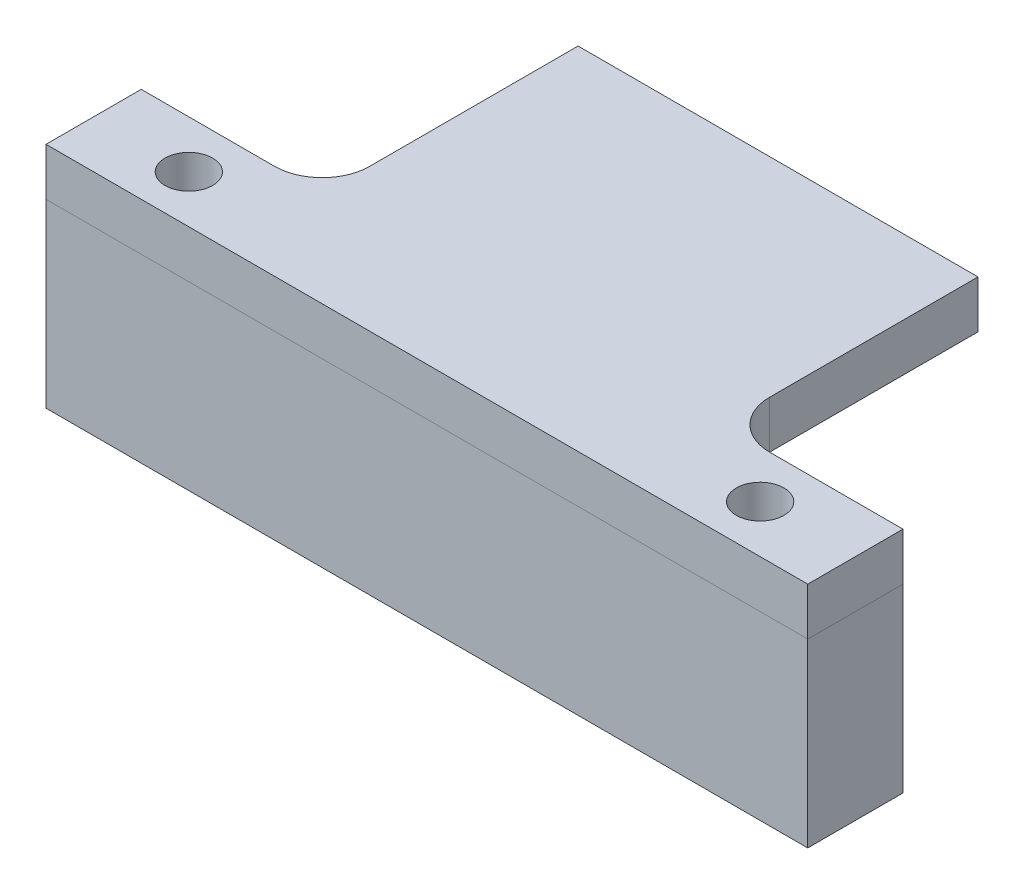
ISO-10303-21;
HEADER;
FILE_DESCRIPTION(('STEP AP214'),'2;1');
FILE_NAME('part.step','',(''),(''),'','','');
FILE_SCHEMA(('AUTOMOTIVE_DESIGN { 1 0 10303 214 1 1 1 1 }'));
ENDSEC;
DATA;
#1=APPLICATION_CONTEXT('core data for automotive mechanical design processes');
#2=APPLICATION_PROTOCOL_DEFINITION('international standard','automotive_design',2000,#1);
#3=PRODUCT_CONTEXT('',#1,'mechanical');
#4=PRODUCT('Part','Part','',(#3));
#5=PRODUCT_RELATED_PRODUCT_CATEGORY('part','',(#4));
#6=PRODUCT_DEFINITION_FORMATION('','',#4);
#7=PRODUCT_DEFINITION_CONTEXT('part definition',#1,'design');
#8=PRODUCT_DEFINITION('design','',#6,#7);
#9=PRODUCT_DEFINITION_SHAPE('','',#8);
#10=(LENGTH_UNIT() NAMED_UNIT(*) SI_UNIT(.MILLI.,.METRE.));
#11=(NAMED_UNIT(*) PLANE_ANGLE_UNIT() SI_UNIT($,.RADIAN.));
#12=(NAMED_UNIT(*) SI_UNIT($,.STERADIAN.) SOLID_ANGLE_UNIT());
#13=UNCERTAINTY_MEASURE_WITH_UNIT(LENGTH_MEASURE(1.E-05),#10,'distance_accuracy_value','');
#14=(GEOMETRIC_REPRESENTATION_CONTEXT(3) GLOBAL_UNCERTAINTY_ASSIGNED_CONTEXT((#13)) GLOBAL_UNIT_ASSIGNED_CONTEXT((#10,
#11,#12)) REPRESENTATION_CONTEXT('',''));
#15=CARTESIAN_POINT('',(0.,0.,0.));
#16=DIRECTION('',(0.,0.,1.));
#17=DIRECTION('',(1.,0.,0.));
#18=AXIS2_PLACEMENT_3D('',#15,#16,#17);
#19=CARTESIAN_POINT('',(0.,15.24,-3.175));
#20=DIRECTION('',(0.,0.,1.));
#21=DIRECTION('',(1.,0.,0.));
#22=AXIS2_PLACEMENT_3D('',#19,#20,#21);
#23=PLANE('',#22);
#24=DIRECTION('',(-1.,0.,0.));
#25=VECTOR('',#24,1.);
#26=CARTESIAN_POINT('',(0.,15.24,-3.175));
#27=LINE('',#26,#25);
#28=CARTESIAN_POINT('',(-16.51,15.24,-3.175));
#29=VERTEX_POINT('',#28);
#30=CARTESIAN_POINT('',(-25.4,15.24,-3.175));
#31=VERTEX_POINT('',#30);
#32=EDGE_CURVE('E173',#29,#31,#27,.T.);
#33=ORIENTED_EDGE('',*,*,#32,.F.);
#34=DIRECTION('',(0.,1.,0.));
#35=VECTOR('',#34,1.);
#36=CARTESIAN_POINT('',(-16.51,15.24,-3.175));
#37=LINE('',#36,#35);
#38=CARTESIAN_POINT('',(-16.51,12.065,-3.175));
#39=VERTEX_POINT('',#38);
#40=EDGE_CURVE('E202',#29,#39,#37,.F.);
#41=ORIENTED_EDGE('',*,*,#40,.T.);
#42=DIRECTION('',(-1.,0.,0.));
#43=VECTOR('',#42,1.);
#44=CARTESIAN_POINT('',(0.,12.065,-3.175));
#45=LINE('',#44,#43);
#46=CARTESIAN_POINT('',(-25.4,12.065,-3.175));
#47=VERTEX_POINT('',#46);
#48=EDGE_CURVE('E183',#39,#47,#45,.T.);
#49=ORIENTED_EDGE('',*,*,#48,.T.);
#50=DIRECTION('',(0.,-1.,0.));
#51=VECTOR('',#50,1.);
#52=CARTESIAN_POINT('',(-25.4,15.24,-3.175));
#53=LINE('',#52,#51);
#54=EDGE_CURVE('E190',#31,#47,#53,.T.);
#55=ORIENTED_EDGE('',*,*,#54,.F.);
#56=EDGE_LOOP('',(#33,#41,#49,#55));
#57=FACE_BOUND('',#56,.T.);
#58=ADVANCED_FACE('F53',(#57),#23,.F.);
#59=CARTESIAN_POINT('',(0.,15.24,3.175));
#60=DIRECTION('',(0.,0.,-1.));
#61=DIRECTION('',(-1.,0.,0.));
#62=AXIS2_PLACEMENT_3D('',#59,#60,#61);
#63=PLANE('',#62);
#64=DIRECTION('',(1.,0.,0.));
#65=VECTOR('',#64,1.);
#66=CARTESIAN_POINT('',(0.,12.065,3.175));
#67=LINE('',#66,#65);
#68=CARTESIAN_POINT('',(-25.4,12.065,3.175));
#69=VERTEX_POINT('',#68);
#70=CARTESIAN_POINT('',(25.4,12.065,3.175));
#71=VERTEX_POINT('',#70);
#72=EDGE_CURVE('E165',#69,#71,#67,.T.);
#73=ORIENTED_EDGE('',*,*,#72,.T.);
#74=DIRECTION('',(0.,-1.,0.));
#75=VECTOR('',#74,1.);
#76=CARTESIAN_POINT('',(25.4,15.24,3.175));
#77=LINE('',#76,#75);
#78=CARTESIAN_POINT('',(25.4,15.24,3.175));
#79=VERTEX_POINT('',#78);
#80=EDGE_CURVE('E196',#79,#71,#77,.T.);
#81=ORIENTED_EDGE('',*,*,#80,.F.);
#82=DIRECTION('',(1.,0.,0.));
#83=VECTOR('',#82,1.);
#84=CARTESIAN_POINT('',(0.,15.24,3.175));
#85=LINE('',#84,#83);
#86=CARTESIAN_POINT('',(-25.4,15.24,3.175));
#87=VERTEX_POINT('',#86);
#88=EDGE_CURVE('E168',#87,#79,#85,.T.);
#89=ORIENTED_EDGE('',*,*,#88,.F.);
#90=DIRECTION('',(0.,-1.,0.));
#91=VECTOR('',#90,1.);
#92=CARTESIAN_POINT('',(-25.4,15.24,3.175));
#93=LINE('',#92,#91);
#94=EDGE_CURVE('E178',#87,#69,#93,.T.);
#95=ORIENTED_EDGE('',*,*,#94,.T.);
#96=EDGE_LOOP('',(#73,#81,#89,#95));
#97=FACE_BOUND('',#96,.T.);
#98=ADVANCED_FACE('F236',(#97),#63,.F.);
#99=CARTESIAN_POINT('',(25.4,15.24,0.));
#100=DIRECTION('',(-1.,0.,0.));
#101=DIRECTION('',(0.,0.,1.));
#102=AXIS2_PLACEMENT_3D('',#99,#100,#101);
#103=PLANE('',#102);
#104=DIRECTION('',(0.,0.,-1.));
#105=VECTOR('',#104,1.);
#106=CARTESIAN_POINT('',(25.4,12.065,0.));
#107=LINE('',#106,#105);
#108=CARTESIAN_POINT('',(25.4,12.065,-3.175));
#109=VERTEX_POINT('',#108);
#110=EDGE_CURVE('E181',#71,#109,#107,.T.);
#111=ORIENTED_EDGE('',*,*,#110,.T.);
#112=DIRECTION('',(0.,-1.,0.));
#113=VECTOR('',#112,1.);
#114=CARTESIAN_POINT('',(25.4,15.24,-3.175));
#115=LINE('',#114,#113);
#116=CARTESIAN_POINT('',(25.4,15.24,-3.175));
#117=VERTEX_POINT('',#116);
#118=EDGE_CURVE('E193',#117,#109,#115,.T.);
#119=ORIENTED_EDGE('',*,*,#118,.F.);
#120=DIRECTION('',(0.,0.,-1.));
#121=VECTOR('',#120,1.);
#122=CARTESIAN_POINT('',(25.4,15.24,0.));
#123=LINE('',#122,#121);
#124=EDGE_CURVE('E170',#79,#117,#123,.T.);
#125=ORIENTED_EDGE('',*,*,#124,.F.);
#126=ORIENTED_EDGE('',*,*,#80,.T.);
#127=EDGE_LOOP('',(#111,#119,#125,#126));
#128=FACE_BOUND('',#127,.T.);
#129=ADVANCED_FACE('F238',(#128),#103,.F.);
#130=CARTESIAN_POINT('',(16.51,12.065,-3.175));
#131=VERTEX_POINT('',#130);
#132=EDGE_CURVE('E184',#109,#131,#45,.T.);
#133=ORIENTED_EDGE('',*,*,#132,.T.);
#134=DIRECTION('',(0.,1.,0.));
#135=VECTOR('',#134,1.);
#136=CARTESIAN_POINT('',(16.51,15.24,-3.175));
#137=LINE('',#136,#135);
#138=CARTESIAN_POINT('',(16.51,15.24,-3.175));
#139=VERTEX_POINT('',#138);
#140=EDGE_CURVE('E204',#131,#139,#137,.T.);
#141=ORIENTED_EDGE('',*,*,#140,.T.);
#142=EDGE_CURVE('E174',#117,#139,#27,.T.);
#143=ORIENTED_EDGE('',*,*,#142,.F.);
#144=ORIENTED_EDGE('',*,*,#118,.T.);
#145=EDGE_LOOP('',(#133,#141,#143,#144));
#146=FACE_BOUND('',#145,.T.);
#147=ADVANCED_FACE('F242',(#146),#23,.F.);
#148=CARTESIAN_POINT('',(-25.4,15.24,0.));
#149=DIRECTION('',(1.,0.,0.));
#150=DIRECTION('',(0.,0.,-1.));
#151=AXIS2_PLACEMENT_3D('',#148,#149,#150);
#152=PLANE('',#151);
#153=DIRECTION('',(0.,0.,1.));
#154=VECTOR('',#153,1.);
#155=CARTESIAN_POINT('',(-25.4,12.065,0.));
#156=LINE('',#155,#154);
#157=EDGE_CURVE('E171',#47,#69,#156,.T.);
#158=ORIENTED_EDGE('',*,*,#157,.T.);
#159=ORIENTED_EDGE('',*,*,#94,.F.);
#160=DIRECTION('',(0.,0.,1.));
#161=VECTOR('',#160,1.);
#162=CARTESIAN_POINT('',(-25.4,15.24,0.));
#163=LINE('',#162,#161);
#164=EDGE_CURVE('E176',#31,#87,#163,.T.);
#165=ORIENTED_EDGE('',*,*,#164,.F.);
#166=ORIENTED_EDGE('',*,*,#54,.T.);
#167=EDGE_LOOP('',(#158,#159,#165,#166));
#168=FACE_BOUND('',#167,.T.);
#169=ADVANCED_FACE('F231',(#168),#152,.F.);
#170=CARTESIAN_POINT('',(0.,15.24,0.));
#171=DIRECTION('',(0.,1.,0.));
#172=DIRECTION('',(0.,0.,1.));
#173=AXIS2_PLACEMENT_3D('',#170,#171,#172);
#174=PLANE('',#173);
#175=CARTESIAN_POINT('',(19.05,15.24,0.));
#176=DIRECTION('',(0.,-1.,0.));
#177=DIRECTION('',(0.,0.,-1.));
#178=AXIS2_PLACEMENT_3D('',#175,#176,#177);
#179=CIRCLE('',#178,1.5875);
#180=CARTESIAN_POINT('',(19.05,15.24,-1.5875));
#181=VERTEX_POINT('',#180);
#182=EDGE_CURVE('E156',#181,#181,#179,.T.);
#183=ORIENTED_EDGE('',*,*,#182,.T.);
#184=EDGE_LOOP('',(#183));
#185=FACE_BOUND('',#184,.T.);
#186=CARTESIAN_POINT('',(-19.05,15.24,0.));
#187=DIRECTION('',(0.,-1.,0.));
#188=DIRECTION('',(0.,0.,-1.));
#189=AXIS2_PLACEMENT_3D('',#186,#187,#188);
#190=CIRCLE('',#189,1.5875);
#191=CARTESIAN_POINT('',(-19.05,15.24,-1.5875));
#192=VERTEX_POINT('',#191);
#193=EDGE_CURVE('E162',#192,#192,#190,.T.);
#194=ORIENTED_EDGE('',*,*,#193,.T.);
#195=EDGE_LOOP('',(#194));
#196=FACE_BOUND('',#195,.T.);
#197=ORIENTED_EDGE('',*,*,#88,.T.);
#198=ORIENTED_EDGE('',*,*,#124,.T.);
#199=ORIENTED_EDGE('',*,*,#142,.T.);
#200=CARTESIAN_POINT('',(16.51,15.24,-6.35));
#201=DIRECTION('',(0.,1.,0.));
#202=DIRECTION('',(0.,0.,1.));
#203=AXIS2_PLACEMENT_3D('',#200,#201,#202);
#204=CIRCLE('',#203,3.175);
#205=CARTESIAN_POINT('',(13.335,15.24,-6.35));
#206=VERTEX_POINT('',#205);
#207=EDGE_CURVE('E61',#139,#206,#204,.F.);
#208=ORIENTED_EDGE('',*,*,#207,.T.);
#209=DIRECTION('',(0.,0.,-1.));
#210=VECTOR('',#209,1.);
#211=CARTESIAN_POINT('',(13.335,15.24,-20.2438));
#212=LINE('',#211,#210);
#213=CARTESIAN_POINT('',(13.335,15.24,-20.2438));
#214=VERTEX_POINT('',#213);
#215=EDGE_CURVE('E127',#206,#214,#212,.T.);
#216=ORIENTED_EDGE('',*,*,#215,.T.);
#217=DIRECTION('',(-1.,0.,0.));
#218=VECTOR('',#217,1.);
#219=CARTESIAN_POINT('',(-13.335,15.24,-20.2438));
#220=LINE('',#219,#218);
#221=CARTESIAN_POINT('',(-13.335,15.24,-20.2438));
#222=VERTEX_POINT('',#221);
#223=EDGE_CURVE('E133',#214,#222,#220,.T.);
#224=ORIENTED_EDGE('',*,*,#223,.T.);
#225=DIRECTION('',(0.,0.,1.));
#226=VECTOR('',#225,1.);
#227=CARTESIAN_POINT('',(-13.335,15.24,-20.2438));
#228=LINE('',#227,#226);
#229=CARTESIAN_POINT('',(-13.335,15.24,-6.35));
#230=VERTEX_POINT('',#229);
#231=EDGE_CURVE('E142',#222,#230,#228,.T.);
#232=ORIENTED_EDGE('',*,*,#231,.T.);
#233=CARTESIAN_POINT('',(-16.51,15.24,-6.35));
#234=DIRECTION('',(0.,1.,0.));
#235=DIRECTION('',(0.,0.,1.));
#236=AXIS2_PLACEMENT_3D('',#233,#234,#235);
#237=CIRCLE('',#236,3.175);
#238=EDGE_CURVE('E208',#230,#29,#237,.F.);
#239=ORIENTED_EDGE('',*,*,#238,.T.);
#240=ORIENTED_EDGE('',*,*,#32,.T.);
#241=ORIENTED_EDGE('',*,*,#164,.T.);
#242=EDGE_LOOP('',(#197,#198,#199,#208,#216,#224,#232,#239,#240,#241));
#243=FACE_BOUND('',#242,.T.);
#244=ADVANCED_FACE('F130',(#185,#196,#243),#174,.T.);
#245=CARTESIAN_POINT('',(0.,12.065,0.));
#246=DIRECTION('',(0.,1.,0.));
#247=DIRECTION('',(0.,0.,1.));
#248=AXIS2_PLACEMENT_3D('',#245,#246,#247);
#249=PLANE('',#248);
#250=CARTESIAN_POINT('',(19.05,12.065,0.));
#251=DIRECTION('',(0.,-1.,0.));
#252=DIRECTION('',(0.,0.,-1.));
#253=AXIS2_PLACEMENT_3D('',#250,#251,#252);
#254=CIRCLE('',#253,1.5875);
#255=CARTESIAN_POINT('',(19.05,12.065,-1.5875));
#256=VERTEX_POINT('',#255);
#257=EDGE_CURVE('E155',#256,#256,#254,.T.);
#258=ORIENTED_EDGE('',*,*,#257,.F.);
#259=EDGE_LOOP('',(#258));
#260=FACE_BOUND('',#259,.T.);
#261=CARTESIAN_POINT('',(-19.05,12.065,0.));
#262=DIRECTION('',(0.,-1.,0.));
#263=DIRECTION('',(0.,0.,-1.));
#264=AXIS2_PLACEMENT_3D('',#261,#262,#263);
#265=CIRCLE('',#264,1.5875);
#266=CARTESIAN_POINT('',(-19.05,12.065,-1.5875));
#267=VERTEX_POINT('',#266);
#268=EDGE_CURVE('E159',#267,#267,#265,.T.);
#269=ORIENTED_EDGE('',*,*,#268,.F.);
#270=EDGE_LOOP('',(#269));
#271=FACE_BOUND('',#270,.T.);
#272=ORIENTED_EDGE('',*,*,#72,.F.);
#273=ORIENTED_EDGE('',*,*,#157,.F.);
#274=ORIENTED_EDGE('',*,*,#48,.F.);
#275=CARTESIAN_POINT('',(-16.51,12.065,-6.35));
#276=DIRECTION('',(0.,1.,0.));
#277=DIRECTION('',(0.,0.,1.));
#278=AXIS2_PLACEMENT_3D('',#275,#276,#277);
#279=CIRCLE('',#278,3.175);
#280=CARTESIAN_POINT('',(-13.335,12.065,-6.35));
#281=VERTEX_POINT('',#280);
#282=EDGE_CURVE('E210',#39,#281,#279,.T.);
#283=ORIENTED_EDGE('',*,*,#282,.T.);
#284=DIRECTION('',(0.,0.,-1.));
#285=VECTOR('',#284,1.);
#286=CARTESIAN_POINT('',(-13.335,12.065,-20.2438));
#287=LINE('',#286,#285);
#288=CARTESIAN_POINT('',(-13.335,12.065,-20.2438));
#289=VERTEX_POINT('',#288);
#290=EDGE_CURVE('E151',#281,#289,#287,.T.);
#291=ORIENTED_EDGE('',*,*,#290,.T.);
#292=DIRECTION('',(1.,0.,0.));
#293=VECTOR('',#292,1.);
#294=CARTESIAN_POINT('',(-13.335,12.065,-20.2438));
#295=LINE('',#294,#293);
#296=CARTESIAN_POINT('',(13.335,12.065,-20.2438));
#297=VERTEX_POINT('',#296);
#298=EDGE_CURVE('E153',#289,#297,#295,.T.);
#299=ORIENTED_EDGE('',*,*,#298,.T.);
#300=DIRECTION('',(0.,0.,1.));
#301=VECTOR('',#300,1.);
#302=CARTESIAN_POINT('',(13.335,12.065,-20.2438));
#303=LINE('',#302,#301);
#304=CARTESIAN_POINT('',(13.335,12.065,-6.35));
#305=VERTEX_POINT('',#304);
#306=EDGE_CURVE('E138',#297,#305,#303,.T.);
#307=ORIENTED_EDGE('',*,*,#306,.T.);
#308=CARTESIAN_POINT('',(16.51,12.065,-6.35));
#309=DIRECTION('',(0.,1.,0.));
#310=DIRECTION('',(0.,0.,1.));
#311=AXIS2_PLACEMENT_3D('',#308,#309,#310);
#312=CIRCLE('',#311,3.175);
#313=EDGE_CURVE('E12',#305,#131,#312,.T.);
#314=ORIENTED_EDGE('',*,*,#313,.T.);
#315=ORIENTED_EDGE('',*,*,#132,.F.);
#316=ORIENTED_EDGE('',*,*,#110,.F.);
#317=EDGE_LOOP('',(#272,#273,#274,#283,#291,#299,#307,#314,#315,#316));
#318=FACE_BOUND('',#317,.T.);
#319=ADVANCED_FACE('F216',(#260,#271,#318),#249,.F.);
#320=CARTESIAN_POINT('',(-19.05,15.24,0.));
#321=DIRECTION('',(0.,-1.,0.));
#322=DIRECTION('',(0.,0.,-1.));
#323=AXIS2_PLACEMENT_3D('',#320,#321,#322);
#324=CYLINDRICAL_SURFACE('',#323,1.5875);
#325=ORIENTED_EDGE('',*,*,#193,.F.);
#326=EDGE_LOOP('',(#325));
#327=FACE_BOUND('',#326,.T.);
#328=ORIENTED_EDGE('',*,*,#268,.T.);
#329=EDGE_LOOP('',(#328));
#330=FACE_BOUND('',#329,.T.);
#331=ADVANCED_FACE('F313',(#327,#330),#324,.F.);
#332=CARTESIAN_POINT('',(19.05,15.24,0.));
#333=DIRECTION('',(0.,-1.,0.));
#334=DIRECTION('',(0.,0.,-1.));
#335=AXIS2_PLACEMENT_3D('',#332,#333,#334);
#336=CYLINDRICAL_SURFACE('',#335,1.5875);
#337=ORIENTED_EDGE('',*,*,#182,.F.);
#338=EDGE_LOOP('',(#337));
#339=FACE_BOUND('',#338,.T.);
#340=ORIENTED_EDGE('',*,*,#257,.T.);
#341=EDGE_LOOP('',(#340));
#342=FACE_BOUND('',#341,.T.);
#343=ADVANCED_FACE('F326',(#339,#342),#336,.F.);
#344=CARTESIAN_POINT('',(13.335,-19.5993779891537,-20.2438));
#345=DIRECTION('',(1.,0.,0.));
#346=DIRECTION('',(0.,0.,-1.));
#347=AXIS2_PLACEMENT_3D('',#344,#345,#346);
#348=PLANE('',#347);
#349=ORIENTED_EDGE('',*,*,#215,.F.);
#350=DIRECTION('',(0.,1.,0.));
#351=VECTOR('',#350,1.);
#352=CARTESIAN_POINT('',(13.335,-19.5993779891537,-6.35));
#353=LINE('',#352,#351);
#354=EDGE_CURVE('E74',#206,#305,#353,.F.);
#355=ORIENTED_EDGE('',*,*,#354,.T.);
#356=ORIENTED_EDGE('',*,*,#306,.F.);
#357=DIRECTION('',(0.,1.,0.));
#358=VECTOR('',#357,1.);
#359=CARTESIAN_POINT('',(13.335,-19.5993779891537,-20.2438));
#360=LINE('',#359,#358);
#361=EDGE_CURVE('E136',#297,#214,#360,.T.);
#362=ORIENTED_EDGE('',*,*,#361,.T.);
#363=EDGE_LOOP('',(#349,#355,#356,#362));
#364=FACE_BOUND('',#363,.T.);
#365=ADVANCED_FACE('F137',(#364),#348,.T.);
#366=CARTESIAN_POINT('',(-13.335,-19.5993779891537,-20.2438));
#367=DIRECTION('',(-1.,0.,0.));
#368=DIRECTION('',(0.,0.,1.));
#369=AXIS2_PLACEMENT_3D('',#366,#367,#368);
#370=PLANE('',#369);
#371=ORIENTED_EDGE('',*,*,#290,.F.);
#372=DIRECTION('',(0.,1.,0.));
#373=VECTOR('',#372,1.);
#374=CARTESIAN_POINT('',(-13.335,-19.5993779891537,-6.35));
#375=LINE('',#374,#373);
#376=EDGE_CURVE('E199',#281,#230,#375,.T.);
#377=ORIENTED_EDGE('',*,*,#376,.T.);
#378=ORIENTED_EDGE('',*,*,#231,.F.);
#379=DIRECTION('',(0.,1.,0.));
#380=VECTOR('',#379,1.);
#381=CARTESIAN_POINT('',(-13.335,-19.5993779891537,-20.2438));
#382=LINE('',#381,#380);
#383=EDGE_CURVE('E141',#289,#222,#382,.T.);
#384=ORIENTED_EDGE('',*,*,#383,.F.);
#385=EDGE_LOOP('',(#371,#377,#378,#384));
#386=FACE_BOUND('',#385,.T.);
#387=ADVANCED_FACE('F222',(#386),#370,.T.);
#388=CARTESIAN_POINT('',(-13.335,-19.5993779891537,-20.2438));
#389=DIRECTION('',(0.,0.,-1.));
#390=DIRECTION('',(-1.,0.,0.));
#391=AXIS2_PLACEMENT_3D('',#388,#389,#390);
#392=PLANE('',#391);
#393=ORIENTED_EDGE('',*,*,#298,.F.);
#394=ORIENTED_EDGE('',*,*,#383,.T.);
#395=ORIENTED_EDGE('',*,*,#223,.F.);
#396=ORIENTED_EDGE('',*,*,#361,.F.);
#397=EDGE_LOOP('',(#393,#394,#395,#396));
#398=FACE_BOUND('',#397,.T.);
#399=ADVANCED_FACE('F144',(#398),#392,.T.);
#400=CARTESIAN_POINT('',(-16.51,-19.5993779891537,-6.35));
#401=DIRECTION('',(0.,1.,0.));
#402=DIRECTION('',(0.,0.,1.));
#403=AXIS2_PLACEMENT_3D('',#400,#401,#402);
#404=CYLINDRICAL_SURFACE('',#403,3.175);
#405=ORIENTED_EDGE('',*,*,#282,.F.);
#406=ORIENTED_EDGE('',*,*,#40,.F.);
#407=ORIENTED_EDGE('',*,*,#238,.F.);
#408=ORIENTED_EDGE('',*,*,#376,.F.);
#409=EDGE_LOOP('',(#405,#406,#407,#408));
#410=FACE_BOUND('',#409,.T.);
#411=ADVANCED_FACE('F224',(#410),#404,.F.);
#412=CARTESIAN_POINT('',(16.51,15.24,-6.35));
#413=DIRECTION('',(0.,1.,0.));
#414=DIRECTION('',(0.,0.,1.));
#415=AXIS2_PLACEMENT_3D('',#412,#413,#414);
#416=CYLINDRICAL_SURFACE('',#415,3.175);
#417=ORIENTED_EDGE('',*,*,#313,.F.);
#418=ORIENTED_EDGE('',*,*,#354,.F.);
#419=ORIENTED_EDGE('',*,*,#207,.F.);
#420=ORIENTED_EDGE('',*,*,#140,.F.);
#421=EDGE_LOOP('',(#417,#418,#419,#420));
#422=FACE_BOUND('',#421,.T.);
#423=ADVANCED_FACE('F55',(#422),#416,.F.);
#424=CLOSED_SHELL('',(#58,#98,#129,#147,#169,#244,#319,#331,#343,#365,#387,#399,#411,#423));
#425=MANIFOLD_SOLID_BREP('B2',#424);
#426=CARTESIAN_POINT('',(0.,12.065,0.));
#427=DIRECTION('',(0.,-1.,0.));
#428=DIRECTION('',(0.,0.,-1.));
#429=AXIS2_PLACEMENT_3D('',#426,#427,#428);
#430=PLANE('',#429);
#431=DIRECTION('',(0.,0.,-1.));
#432=VECTOR('',#431,1.);
#433=CARTESIAN_POINT('',(25.4,12.065,3.175));
#434=LINE('',#433,#432);
#435=CARTESIAN_POINT('',(25.4,12.065,3.175));
#436=VERTEX_POINT('',#435);
#437=CARTESIAN_POINT('',(25.4,12.065,-3.175));
#438=VERTEX_POINT('',#437);
#439=EDGE_CURVE('E458',#436,#438,#434,.T.);
#440=ORIENTED_EDGE('',*,*,#439,.T.);
#441=DIRECTION('',(-1.,0.,0.));
#442=VECTOR('',#441,1.);
#443=CARTESIAN_POINT('',(-25.4,12.065,-3.175));
#444=LINE('',#443,#442);
#445=CARTESIAN_POINT('',(-25.4,12.065,-3.175));
#446=VERTEX_POINT('',#445);
#447=EDGE_CURVE('E453',#438,#446,#444,.T.);
#448=ORIENTED_EDGE('',*,*,#447,.T.);
#449=DIRECTION('',(0.,0.,1.));
#450=VECTOR('',#449,1.);
#451=CARTESIAN_POINT('',(-25.4,12.065,3.175));
#452=LINE('',#451,#450);
#453=CARTESIAN_POINT('',(-25.4,12.065,3.175));
#454=VERTEX_POINT('',#453);
#455=EDGE_CURVE('E456',#446,#454,#452,.T.);
#456=ORIENTED_EDGE('',*,*,#455,.T.);
#457=DIRECTION('',(1.,0.,0.));
#458=VECTOR('',#457,1.);
#459=CARTESIAN_POINT('',(-25.4,12.065,3.175));
#460=LINE('',#459,#458);
#461=EDGE_CURVE('E423',#454,#436,#460,.T.);
#462=ORIENTED_EDGE('',*,*,#461,.T.);
#463=EDGE_LOOP('',(#440,#448,#456,#462));
#464=FACE_BOUND('',#463,.T.);
#465=CARTESIAN_POINT('',(-19.05,12.065,0.));
#466=DIRECTION('',(0.,1.,0.));
#467=DIRECTION('',(0.,0.,1.));
#468=AXIS2_PLACEMENT_3D('',#465,#466,#467);
#469=CIRCLE('',#468,1.5875);
#470=CARTESIAN_POINT('',(-19.05,12.065,-1.5875));
#471=VERTEX_POINT('',#470);
#472=EDGE_CURVE('E473',#471,#471,#469,.T.);
#473=ORIENTED_EDGE('',*,*,#472,.F.);
#474=EDGE_LOOP('',(#473));
#475=FACE_BOUND('',#474,.T.);
#476=CARTESIAN_POINT('',(19.05,12.065,0.));
#477=DIRECTION('',(0.,1.,0.));
#478=DIRECTION('',(0.,0.,1.));
#479=AXIS2_PLACEMENT_3D('',#476,#477,#478);
#480=CIRCLE('',#479,1.5875);
#481=CARTESIAN_POINT('',(19.05,12.065,-1.5875));
#482=VERTEX_POINT('',#481);
#483=EDGE_CURVE('E488',#482,#482,#480,.T.);
#484=ORIENTED_EDGE('',*,*,#483,.F.);
#485=EDGE_LOOP('',(#484));
#486=FACE_BOUND('',#485,.T.);
#487=ADVANCED_FACE('F406',(#464,#475,#486),#430,.F.);
#488=CARTESIAN_POINT('',(0.,0.,0.));
#489=DIRECTION('',(0.,-1.,0.));
#490=DIRECTION('',(0.,0.,-1.));
#491=AXIS2_PLACEMENT_3D('',#488,#489,#490);
#492=PLANE('',#491);
#493=CARTESIAN_POINT('',(-19.05,0.,0.));
#494=DIRECTION('',(0.,1.,0.));
#495=DIRECTION('',(0.,0.,1.));
#496=AXIS2_PLACEMENT_3D('',#493,#494,#495);
#497=CIRCLE('',#496,1.5875);
#498=CARTESIAN_POINT('',(-19.05,0.,-1.5875));
#499=VERTEX_POINT('',#498);
#500=EDGE_CURVE('E485',#499,#499,#497,.T.);
#501=ORIENTED_EDGE('',*,*,#500,.T.);
#502=EDGE_LOOP('',(#501));
#503=FACE_BOUND('',#502,.T.);
#504=DIRECTION('',(0.,0.,-1.));
#505=VECTOR('',#504,1.);
#506=CARTESIAN_POINT('',(25.4,0.,3.175));
#507=LINE('',#506,#505);
#508=CARTESIAN_POINT('',(25.4,0.,3.175));
#509=VERTEX_POINT('',#508);
#510=CARTESIAN_POINT('',(25.4,0.,-3.175));
#511=VERTEX_POINT('',#510);
#512=EDGE_CURVE('E470',#509,#511,#507,.T.);
#513=ORIENTED_EDGE('',*,*,#512,.F.);
#514=DIRECTION('',(1.,0.,0.));
#515=VECTOR('',#514,1.);
#516=CARTESIAN_POINT('',(-25.4,0.,3.175));
#517=LINE('',#516,#515);
#518=CARTESIAN_POINT('',(-25.4,0.,3.175));
#519=VERTEX_POINT('',#518);
#520=EDGE_CURVE('E446',#519,#509,#517,.T.);
#521=ORIENTED_EDGE('',*,*,#520,.F.);
#522=DIRECTION('',(0.,0.,1.));
#523=VECTOR('',#522,1.);
#524=CARTESIAN_POINT('',(-25.4,0.,3.175));
#525=LINE('',#524,#523);
#526=CARTESIAN_POINT('',(-25.4,0.,-3.175));
#527=VERTEX_POINT('',#526);
#528=EDGE_CURVE('E440',#527,#519,#525,.T.);
#529=ORIENTED_EDGE('',*,*,#528,.F.);
#530=DIRECTION('',(-1.,0.,0.));
#531=VECTOR('',#530,1.);
#532=CARTESIAN_POINT('',(-25.4,0.,-3.175));
#533=LINE('',#532,#531);
#534=EDGE_CURVE('E462',#511,#527,#533,.T.);
#535=ORIENTED_EDGE('',*,*,#534,.F.);
#536=EDGE_LOOP('',(#513,#521,#529,#535));
#537=FACE_BOUND('',#536,.T.);
#538=CARTESIAN_POINT('',(19.05,0.,0.));
#539=DIRECTION('',(0.,1.,0.));
#540=DIRECTION('',(0.,0.,1.));
#541=AXIS2_PLACEMENT_3D('',#538,#539,#540);
#542=CIRCLE('',#541,1.5875);
#543=CARTESIAN_POINT('',(19.05,0.,-1.5875));
#544=VERTEX_POINT('',#543);
#545=EDGE_CURVE('E491',#544,#544,#542,.T.);
#546=ORIENTED_EDGE('',*,*,#545,.T.);
#547=EDGE_LOOP('',(#546));
#548=FACE_BOUND('',#547,.T.);
#549=ADVANCED_FACE('F481',(#503,#537,#548),#492,.T.);
#550=CARTESIAN_POINT('',(25.4,12.065,3.175));
#551=DIRECTION('',(-1.,0.,0.));
#552=DIRECTION('',(0.,0.,1.));
#553=AXIS2_PLACEMENT_3D('',#550,#551,#552);
#554=PLANE('',#553);
#555=ORIENTED_EDGE('',*,*,#512,.T.);
#556=DIRECTION('',(0.,-1.,0.));
#557=VECTOR('',#556,1.);
#558=CARTESIAN_POINT('',(25.4,12.065,-3.175));
#559=LINE('',#558,#557);
#560=EDGE_CURVE('E51',#438,#511,#559,.T.);
#561=ORIENTED_EDGE('',*,*,#560,.F.);
#562=ORIENTED_EDGE('',*,*,#439,.F.);
#563=DIRECTION('',(0.,-1.,0.));
#564=VECTOR('',#563,1.);
#565=CARTESIAN_POINT('',(25.4,12.065,3.175));
#566=LINE('',#565,#564);
#567=EDGE_CURVE('E466',#436,#509,#566,.T.);
#568=ORIENTED_EDGE('',*,*,#567,.T.);
#569=EDGE_LOOP('',(#555,#561,#562,#568));
#570=FACE_BOUND('',#569,.T.);
#571=ADVANCED_FACE('F408',(#570),#554,.F.);
#572=CARTESIAN_POINT('',(-25.4,12.065,-3.175));
#573=DIRECTION('',(0.,0.,1.));
#574=DIRECTION('',(1.,0.,0.));
#575=AXIS2_PLACEMENT_3D('',#572,#573,#574);
#576=PLANE('',#575);
#577=ORIENTED_EDGE('',*,*,#534,.T.);
#578=DIRECTION('',(0.,-1.,0.));
#579=VECTOR('',#578,1.);
#580=CARTESIAN_POINT('',(-25.4,12.065,-3.175));
#581=LINE('',#580,#579);
#582=EDGE_CURVE('E415',#446,#527,#581,.T.);
#583=ORIENTED_EDGE('',*,*,#582,.F.);
#584=ORIENTED_EDGE('',*,*,#447,.F.);
#585=ORIENTED_EDGE('',*,*,#560,.T.);
#586=EDGE_LOOP('',(#577,#583,#584,#585));
#587=FACE_BOUND('',#586,.T.);
#588=ADVANCED_FACE('F461',(#587),#576,.F.);
#589=CARTESIAN_POINT('',(-25.4,12.065,3.175));
#590=DIRECTION('',(1.,0.,0.));
#591=DIRECTION('',(0.,0.,-1.));
#592=AXIS2_PLACEMENT_3D('',#589,#590,#591);
#593=PLANE('',#592);
#594=ORIENTED_EDGE('',*,*,#528,.T.);
#595=DIRECTION('',(0.,-1.,0.));
#596=VECTOR('',#595,1.);
#597=CARTESIAN_POINT('',(-25.4,12.065,3.175));
#598=LINE('',#597,#596);
#599=EDGE_CURVE('E463',#454,#519,#598,.T.);
#600=ORIENTED_EDGE('',*,*,#599,.F.);
#601=ORIENTED_EDGE('',*,*,#455,.F.);
#602=ORIENTED_EDGE('',*,*,#582,.T.);
#603=EDGE_LOOP('',(#594,#600,#601,#602));
#604=FACE_BOUND('',#603,.T.);
#605=ADVANCED_FACE('F464',(#604),#593,.F.);
#606=CARTESIAN_POINT('',(-25.4,12.065,3.175));
#607=DIRECTION('',(0.,0.,-1.));
#608=DIRECTION('',(-1.,0.,0.));
#609=AXIS2_PLACEMENT_3D('',#606,#607,#608);
#610=PLANE('',#609);
#611=ORIENTED_EDGE('',*,*,#520,.T.);
#612=ORIENTED_EDGE('',*,*,#567,.F.);
#613=ORIENTED_EDGE('',*,*,#461,.F.);
#614=ORIENTED_EDGE('',*,*,#599,.T.);
#615=EDGE_LOOP('',(#611,#612,#613,#614));
#616=FACE_BOUND('',#615,.T.);
#617=ADVANCED_FACE('F478',(#616),#610,.F.);
#618=CARTESIAN_POINT('',(-19.05,12.065,0.));
#619=DIRECTION('',(0.,-1.,0.));
#620=DIRECTION('',(0.,0.,-1.));
#621=AXIS2_PLACEMENT_3D('',#618,#619,#620);
#622=CYLINDRICAL_SURFACE('',#621,1.5875);
#623=CARTESIAN_POINT('',(-19.05,12.065,-1.5875));
#624=CARTESIAN_POINT('',(-19.05,11.9393229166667,-1.5875));
#625=CARTESIAN_POINT('',(-19.05,11.8136458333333,-1.5875));
#626=CARTESIAN_POINT('',(-19.05,11.5622916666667,-1.5875));
#627=CARTESIAN_POINT('',(-19.05,11.4366145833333,-1.5875));
#628=CARTESIAN_POINT('',(-19.05,11.1852604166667,-1.5875));
#629=CARTESIAN_POINT('',(-19.05,11.0595833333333,-1.5875));
#630=CARTESIAN_POINT('',(-19.05,10.8082291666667,-1.5875));
#631=CARTESIAN_POINT('',(-19.05,10.6825520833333,-1.5875));
#632=CARTESIAN_POINT('',(-19.05,10.4311979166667,-1.5875));
#633=CARTESIAN_POINT('',(-19.05,10.3055208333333,-1.5875));
#634=CARTESIAN_POINT('',(-19.05,10.0541666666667,-1.5875));
#635=CARTESIAN_POINT('',(-19.05,9.92848958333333,-1.5875));
#636=CARTESIAN_POINT('',(-19.05,9.67713541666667,-1.5875));
#637=CARTESIAN_POINT('',(-19.05,9.55145833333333,-1.5875));
#638=CARTESIAN_POINT('',(-19.05,9.30010416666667,-1.5875));
#639=CARTESIAN_POINT('',(-19.05,9.17442708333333,-1.5875));
#640=CARTESIAN_POINT('',(-19.05,8.92307291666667,-1.5875));
#641=CARTESIAN_POINT('',(-19.05,8.79739583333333,-1.5875));
#642=CARTESIAN_POINT('',(-19.05,8.54604166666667,-1.5875));
#643=CARTESIAN_POINT('',(-19.05,8.42036458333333,-1.5875));
#644=CARTESIAN_POINT('',(-19.05,8.16901041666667,-1.5875));
#645=CARTESIAN_POINT('',(-19.05,8.04333333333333,-1.5875));
#646=CARTESIAN_POINT('',(-19.05,7.79197916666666,-1.5875));
#647=CARTESIAN_POINT('',(-19.05,7.66630208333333,-1.5875));
#648=CARTESIAN_POINT('',(-19.05,7.41494791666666,-1.5875));
#649=CARTESIAN_POINT('',(-19.05,7.28927083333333,-1.5875));
#650=CARTESIAN_POINT('',(-19.05,7.03791666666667,-1.5875));
#651=CARTESIAN_POINT('',(-19.05,6.91223958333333,-1.5875));
#652=CARTESIAN_POINT('',(-19.05,6.66088541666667,-1.5875));
#653=CARTESIAN_POINT('',(-19.05,6.53520833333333,-1.5875));
#654=CARTESIAN_POINT('',(-19.05,6.28385416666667,-1.5875));
#655=CARTESIAN_POINT('',(-19.05,6.15817708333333,-1.5875));
#656=CARTESIAN_POINT('',(-19.05,5.90682291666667,-1.5875));
#657=CARTESIAN_POINT('',(-19.05,5.78114583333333,-1.5875));
#658=CARTESIAN_POINT('',(-19.05,5.52979166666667,-1.5875));
#659=CARTESIAN_POINT('',(-19.05,5.40411458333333,-1.5875));
#660=CARTESIAN_POINT('',(-19.05,5.15276041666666,-1.5875));
#661=CARTESIAN_POINT('',(-19.05,5.02708333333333,-1.5875));
#662=CARTESIAN_POINT('',(-19.05,4.77572916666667,-1.5875));
#663=CARTESIAN_POINT('',(-19.05,4.65005208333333,-1.5875));
#664=CARTESIAN_POINT('',(-19.05,4.39869791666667,-1.5875));
#665=CARTESIAN_POINT('',(-19.05,4.27302083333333,-1.5875));
#666=CARTESIAN_POINT('',(-19.05,4.02166666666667,-1.5875));
#667=CARTESIAN_POINT('',(-19.05,3.89598958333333,-1.5875));
#668=CARTESIAN_POINT('',(-19.05,3.64463541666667,-1.5875));
#669=CARTESIAN_POINT('',(-19.05,3.51895833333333,-1.5875));
#670=CARTESIAN_POINT('',(-19.05,3.26760416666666,-1.5875));
#671=CARTESIAN_POINT('',(-19.05,3.14192708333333,-1.5875));
#672=CARTESIAN_POINT('',(-19.05,2.89057291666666,-1.5875));
#673=CARTESIAN_POINT('',(-19.05,2.76489583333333,-1.5875));
#674=CARTESIAN_POINT('',(-19.05,2.51354166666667,-1.5875));
#675=CARTESIAN_POINT('',(-19.05,2.38786458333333,-1.5875));
#676=CARTESIAN_POINT('',(-19.05,2.13651041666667,-1.5875));
#677=CARTESIAN_POINT('',(-19.05,2.01083333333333,-1.5875));
#678=CARTESIAN_POINT('',(-19.05,1.75947916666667,-1.5875));
#679=CARTESIAN_POINT('',(-19.05,1.63380208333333,-1.5875));
#680=CARTESIAN_POINT('',(-19.05,1.38244791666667,-1.5875));
#681=CARTESIAN_POINT('',(-19.05,1.25677083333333,-1.5875));
#682=CARTESIAN_POINT('',(-19.05,1.00541666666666,-1.5875));
#683=CARTESIAN_POINT('',(-19.05,0.879739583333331,-1.5875));
#684=CARTESIAN_POINT('',(-19.05,0.628385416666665,-1.5875));
#685=CARTESIAN_POINT('',(-19.05,0.502708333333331,-1.5875));
#686=CARTESIAN_POINT('',(-19.05,0.251354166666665,-1.5875));
#687=CARTESIAN_POINT('',(-19.05,0.125677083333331,-1.5875));
#688=CARTESIAN_POINT('',(-19.05,0.,-1.5875));
#689=B_SPLINE_CURVE_WITH_KNOTS('',3,(#623,#624,#625,#626,#627,#628,#629,#630,#631,#632,#633,
#634,#635,#636,#637,#638,#639,#640,#641,#642,#643,#644,#645,#646,#647,#648,#649,#650,#651,#652,
#653,#654,#655,#656,#657,#658,#659,#660,#661,#662,#663,#664,#665,#666,#667,#668,#669,#670,#671,
#672,#673,#674,#675,#676,#677,#678,#679,#680,#681,#682,#683,#684,#685,#686,#687,#688),
.UNSPECIFIED.,.F.,.F.,(4,2,2,2,2,2,2,2,2,2,2,2,2,2,2,2,2,2,2,2,2,2,2,2,2,2,2,2,2,2,2,2,4),(0.,
0.37703125,0.7540625,1.13109375,1.508125,1.88515625,2.2621875,2.63921875,3.01625,3.39328125,
3.7703125,4.14734375,4.524375,4.90140625,5.2784375,5.65546875,6.0325,6.40953125,6.7865625,
7.16359375,7.540625,7.91765625,8.2946875,8.67171875,9.04875,9.42578125,9.8028125,10.17984375,
10.556875,10.93390625,11.3109375,11.68796875,12.065),.UNSPECIFIED.);
#690=EDGE_CURVE('BSEAM508',#471,#499,#689,.T.);
#691=ORIENTED_EDGE('',*,*,#472,.T.);
#692=ORIENTED_EDGE('',*,*,#500,.F.);
#693=ORIENTED_EDGE('',*,*,#690,.T.);
#694=ORIENTED_EDGE('',*,*,#690,.F.);
#695=EDGE_LOOP('',(#691,#693,#692,#694));
#696=FACE_BOUND('',#695,.T.);
#697=ADVANCED_FACE('F508',(#696),#622,.F.);
#698=CARTESIAN_POINT('',(19.05,12.065,0.));
#699=DIRECTION('',(0.,-1.,0.));
#700=DIRECTION('',(0.,0.,-1.));
#701=AXIS2_PLACEMENT_3D('',#698,#699,#700);
#702=CYLINDRICAL_SURFACE('',#701,1.5875);
#703=CARTESIAN_POINT('',(19.05,12.065,-1.5875));
#704=CARTESIAN_POINT('',(19.05,11.9393229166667,-1.5875));
#705=CARTESIAN_POINT('',(19.05,11.8136458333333,-1.5875));
#706=CARTESIAN_POINT('',(19.05,11.5622916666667,-1.5875));
#707=CARTESIAN_POINT('',(19.05,11.4366145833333,-1.5875));
#708=CARTESIAN_POINT('',(19.05,11.1852604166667,-1.5875));
#709=CARTESIAN_POINT('',(19.05,11.0595833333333,-1.5875));
#710=CARTESIAN_POINT('',(19.05,10.8082291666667,-1.5875));
#711=CARTESIAN_POINT('',(19.05,10.6825520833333,-1.5875));
#712=CARTESIAN_POINT('',(19.05,10.4311979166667,-1.5875));
#713=CARTESIAN_POINT('',(19.05,10.3055208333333,-1.5875));
#714=CARTESIAN_POINT('',(19.05,10.0541666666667,-1.5875));
#715=CARTESIAN_POINT('',(19.05,9.92848958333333,-1.5875));
#716=CARTESIAN_POINT('',(19.05,9.67713541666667,-1.5875));
#717=CARTESIAN_POINT('',(19.05,9.55145833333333,-1.5875));
#718=CARTESIAN_POINT('',(19.05,9.30010416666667,-1.5875));
#719=CARTESIAN_POINT('',(19.05,9.17442708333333,-1.5875));
#720=CARTESIAN_POINT('',(19.05,8.92307291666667,-1.5875));
#721=CARTESIAN_POINT('',(19.05,8.79739583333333,-1.5875));
#722=CARTESIAN_POINT('',(19.05,8.54604166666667,-1.5875));
#723=CARTESIAN_POINT('',(19.05,8.42036458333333,-1.5875));
#724=CARTESIAN_POINT('',(19.05,8.16901041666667,-1.5875));
#725=CARTESIAN_POINT('',(19.05,8.04333333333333,-1.5875));
#726=CARTESIAN_POINT('',(19.05,7.79197916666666,-1.5875));
#727=CARTESIAN_POINT('',(19.05,7.66630208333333,-1.5875));
#728=CARTESIAN_POINT('',(19.05,7.41494791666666,-1.5875));
#729=CARTESIAN_POINT('',(19.05,7.28927083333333,-1.5875));
#730=CARTESIAN_POINT('',(19.05,7.03791666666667,-1.5875));
#731=CARTESIAN_POINT('',(19.05,6.91223958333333,-1.5875));
#732=CARTESIAN_POINT('',(19.05,6.66088541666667,-1.5875));
#733=CARTESIAN_POINT('',(19.05,6.53520833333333,-1.5875));
#734=CARTESIAN_POINT('',(19.05,6.28385416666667,-1.5875));
#735=CARTESIAN_POINT('',(19.05,6.15817708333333,-1.5875));
#736=CARTESIAN_POINT('',(19.05,5.90682291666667,-1.5875));
#737=CARTESIAN_POINT('',(19.05,5.78114583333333,-1.5875));
#738=CARTESIAN_POINT('',(19.05,5.52979166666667,-1.5875));
#739=CARTESIAN_POINT('',(19.05,5.40411458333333,-1.5875));
#740=CARTESIAN_POINT('',(19.05,5.15276041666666,-1.5875));
#741=CARTESIAN_POINT('',(19.05,5.02708333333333,-1.5875));
#742=CARTESIAN_POINT('',(19.05,4.77572916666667,-1.5875));
#743=CARTESIAN_POINT('',(19.05,4.65005208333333,-1.5875));
#744=CARTESIAN_POINT('',(19.05,4.39869791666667,-1.5875));
#745=CARTESIAN_POINT('',(19.05,4.27302083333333,-1.5875));
#746=CARTESIAN_POINT('',(19.05,4.02166666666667,-1.5875));
#747=CARTESIAN_POINT('',(19.05,3.89598958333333,-1.5875));
#748=CARTESIAN_POINT('',(19.05,3.64463541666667,-1.5875));
#749=CARTESIAN_POINT('',(19.05,3.51895833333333,-1.5875));
#750=CARTESIAN_POINT('',(19.05,3.26760416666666,-1.5875));
#751=CARTESIAN_POINT('',(19.05,3.14192708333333,-1.5875));
#752=CARTESIAN_POINT('',(19.05,2.89057291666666,-1.5875));
#753=CARTESIAN_POINT('',(19.05,2.76489583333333,-1.5875));
#754=CARTESIAN_POINT('',(19.05,2.51354166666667,-1.5875));
#755=CARTESIAN_POINT('',(19.05,2.38786458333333,-1.5875));
#756=CARTESIAN_POINT('',(19.05,2.13651041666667,-1.5875));
#757=CARTESIAN_POINT('',(19.05,2.01083333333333,-1.5875));
#758=CARTESIAN_POINT('',(19.05,1.75947916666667,-1.5875));
#759=CARTESIAN_POINT('',(19.05,1.63380208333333,-1.5875));
#760=CARTESIAN_POINT('',(19.05,1.38244791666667,-1.5875));
#761=CARTESIAN_POINT('',(19.05,1.25677083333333,-1.5875));
#762=CARTESIAN_POINT('',(19.05,1.00541666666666,-1.5875));
#763=CARTESIAN_POINT('',(19.05,0.879739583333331,-1.5875));
#764=CARTESIAN_POINT('',(19.05,0.628385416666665,-1.5875));
#765=CARTESIAN_POINT('',(19.05,0.502708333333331,-1.5875));
#766=CARTESIAN_POINT('',(19.05,0.251354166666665,-1.5875));
#767=CARTESIAN_POINT('',(19.05,0.125677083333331,-1.5875));
#768=CARTESIAN_POINT('',(19.05,0.,-1.5875));
#769=B_SPLINE_CURVE_WITH_KNOTS('',3,(#703,#704,#705,#706,#707,#708,#709,#710,#711,#712,#713,
#714,#715,#716,#717,#718,#719,#720,#721,#722,#723,#724,#725,#726,#727,#728,#729,#730,#731,#732,
#733,#734,#735,#736,#737,#738,#739,#740,#741,#742,#743,#744,#745,#746,#747,#748,#749,#750,#751,
#752,#753,#754,#755,#756,#757,#758,#759,#760,#761,#762,#763,#764,#765,#766,#767,#768),
.UNSPECIFIED.,.F.,.F.,(4,2,2,2,2,2,2,2,2,2,2,2,2,2,2,2,2,2,2,2,2,2,2,2,2,2,2,2,2,2,2,2,4),(0.,
0.37703125,0.7540625,1.13109375,1.508125,1.88515625,2.2621875,2.63921875,3.01625,3.39328125,
3.7703125,4.14734375,4.524375,4.90140625,5.2784375,5.65546875,6.0325,6.40953125,6.7865625,
7.16359375,7.540625,7.91765625,8.2946875,8.67171875,9.04875,9.42578125,9.8028125,10.17984375,
10.556875,10.93390625,11.3109375,11.68796875,12.065),.UNSPECIFIED.);
#770=EDGE_CURVE('BSEAM497',#482,#544,#769,.T.);
#771=ORIENTED_EDGE('',*,*,#483,.T.);
#772=ORIENTED_EDGE('',*,*,#545,.F.);
#773=ORIENTED_EDGE('',*,*,#770,.T.);
#774=ORIENTED_EDGE('',*,*,#770,.F.);
#775=EDGE_LOOP('',(#771,#773,#772,#774));
#776=FACE_BOUND('',#775,.T.);
#777=ADVANCED_FACE('F497',(#776),#702,.F.);
#778=CLOSED_SHELL('',(#487,#549,#571,#588,#605,#617,#697,#777));
#779=MANIFOLD_SOLID_BREP('B6',#778);
#780=ADVANCED_BREP_SHAPE_REPRESENTATION('',(#18,#425,#779),#14);
#781=SHAPE_DEFINITION_REPRESENTATION(#9,#780);
ENDSEC;
END-ISO-10303-21;
